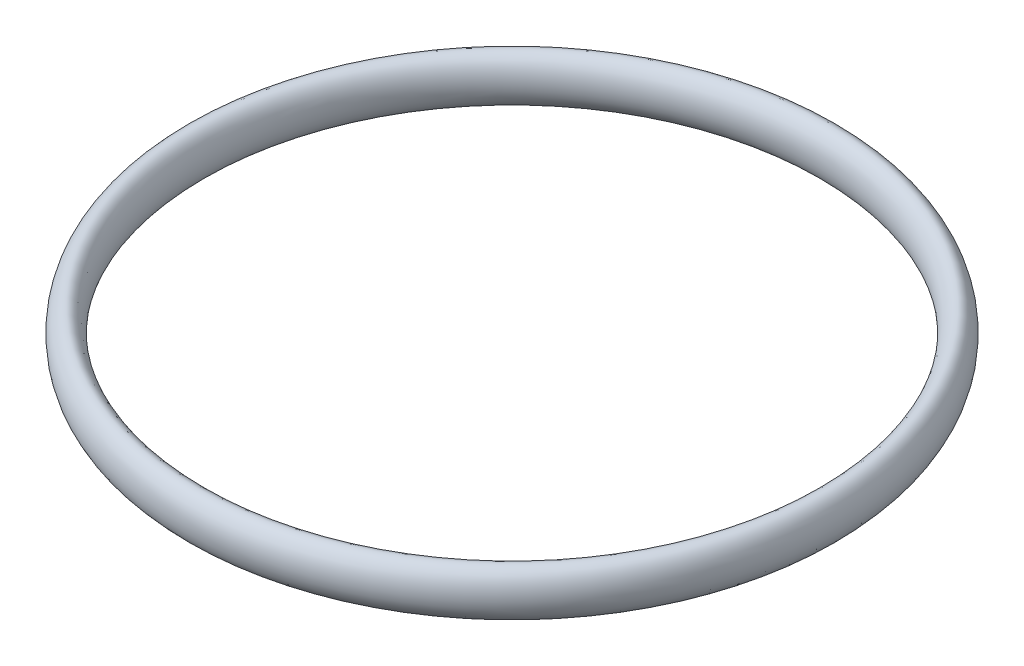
from build123d import *

# Parameters (mm, degrees)
ESQUISSE1_RX = 3.55
ESQUISSE1_RY = 2.175


with BuildPart() as part:
    # Esquisse1 → R_volution1 (revolve)
    with BuildSketch(Plane.XY):
        with Locations(Location((-47.825, -3.55), (0, 0, 90))):
            Ellipse(ESQUISSE1_RX, ESQUISSE1_RY)
    revolve(axis=Axis((0, 51.673755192, 0), (0, -1, 0)))


solid = part.part
